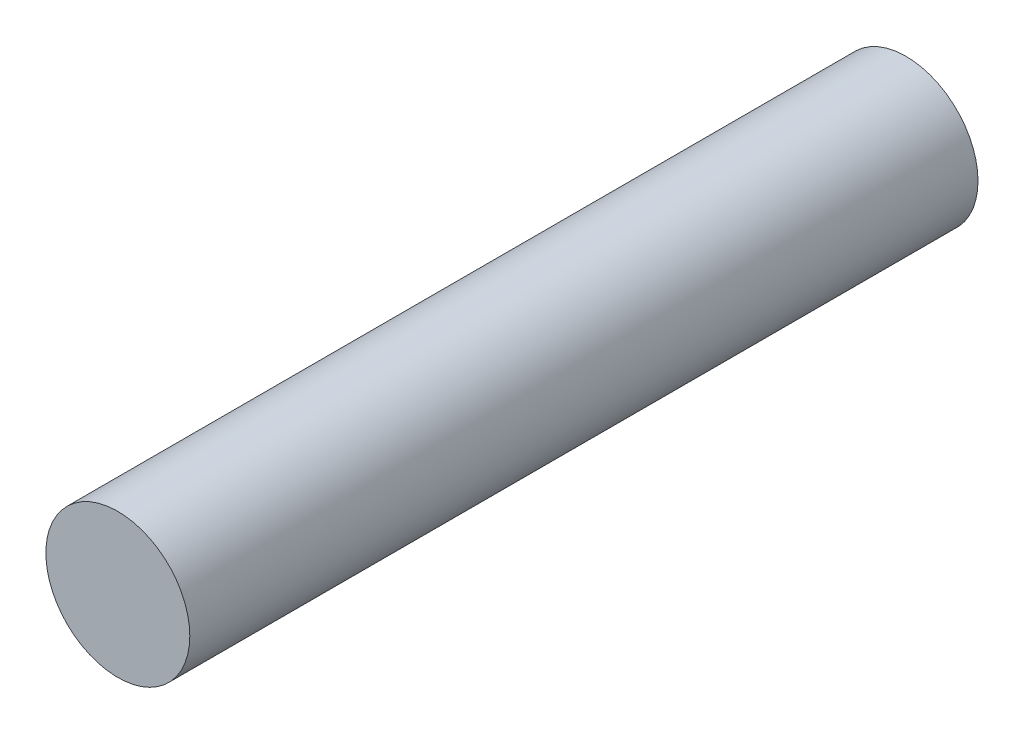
from build123d import *

# Parameters (mm, degrees)
SKETCH1_R           = 13.335
BOSS_EXTRUDE1_DEPTH = 146.05


with BuildPart() as part:
    # Sketch1 → Boss-Extrude1 (new body)
    with BuildSketch(Plane.XY):
        Circle(SKETCH1_R)
    extrude(amount=BOSS_EXTRUDE1_DEPTH)


solid = part.part
